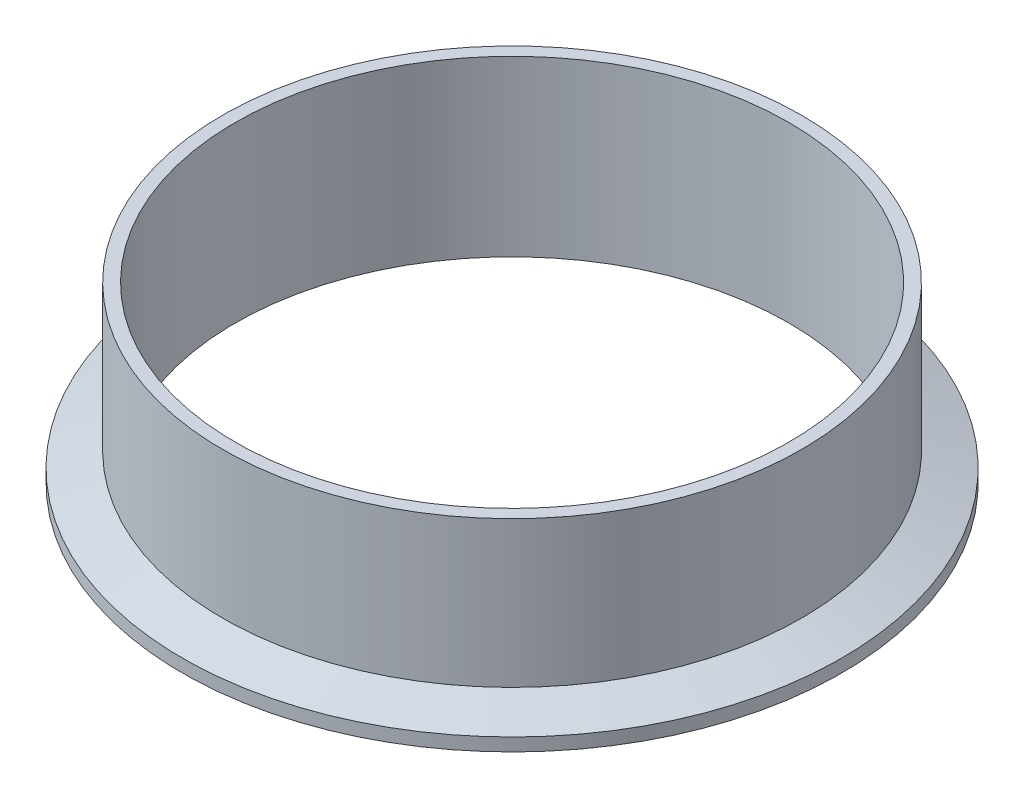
ISO-10303-21;
HEADER;
FILE_DESCRIPTION(('STEP AP214'),'2;1');
FILE_NAME('part.step','',(''),(''),'','','');
FILE_SCHEMA(('AUTOMOTIVE_DESIGN { 1 0 10303 214 1 1 1 1 }'));
ENDSEC;
DATA;
#1=APPLICATION_CONTEXT('core data for automotive mechanical design processes');
#2=APPLICATION_PROTOCOL_DEFINITION('international standard','automotive_design',2000,#1);
#3=PRODUCT_CONTEXT('',#1,'mechanical');
#4=PRODUCT('Part','Part','',(#3));
#5=PRODUCT_RELATED_PRODUCT_CATEGORY('part','',(#4));
#6=PRODUCT_DEFINITION_FORMATION('','',#4);
#7=PRODUCT_DEFINITION_CONTEXT('part definition',#1,'design');
#8=PRODUCT_DEFINITION('design','',#6,#7);
#9=PRODUCT_DEFINITION_SHAPE('','',#8);
#10=(LENGTH_UNIT() NAMED_UNIT(*) SI_UNIT(.MILLI.,.METRE.));
#11=(NAMED_UNIT(*) PLANE_ANGLE_UNIT() SI_UNIT($,.RADIAN.));
#12=(NAMED_UNIT(*) SI_UNIT($,.STERADIAN.) SOLID_ANGLE_UNIT());
#13=UNCERTAINTY_MEASURE_WITH_UNIT(LENGTH_MEASURE(1.E-05),#10,'distance_accuracy_value','');
#14=(GEOMETRIC_REPRESENTATION_CONTEXT(3) GLOBAL_UNCERTAINTY_ASSIGNED_CONTEXT((#13)) GLOBAL_UNIT_ASSIGNED_CONTEXT((#10,
#11,#12)) REPRESENTATION_CONTEXT('',''));
#15=CARTESIAN_POINT('',(0.,0.,0.));
#16=DIRECTION('',(0.,0.,1.));
#17=DIRECTION('',(1.,0.,0.));
#18=AXIS2_PLACEMENT_3D('',#15,#16,#17);
#19=CARTESIAN_POINT('',(0.,0.7874,0.));
#20=DIRECTION('',(0.,-1.,0.));
#21=DIRECTION('',(0.,0.,-1.));
#22=AXIS2_PLACEMENT_3D('',#19,#20,#21);
#23=TOROIDAL_SURFACE('',#22,69.2804084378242,0.787400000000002);
#24=CARTESIAN_POINT('',(0.,0.,0.));
#25=DIRECTION('',(0.,-1.,0.));
#26=DIRECTION('',(0.,0.,-1.));
#27=AXIS2_PLACEMENT_3D('',#24,#25,#26);
#28=CIRCLE('',#27,69.2804084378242);
#29=CARTESIAN_POINT('',(0.,0.,-69.2804084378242));
#30=VERTEX_POINT('',#29);
#31=EDGE_CURVE('E67',#30,#30,#28,.T.);
#32=ORIENTED_EDGE('',*,*,#31,.T.);
#33=EDGE_LOOP('',(#32));
#34=FACE_BOUND('',#33,.T.);
#35=CARTESIAN_POINT('',(0.,0.474458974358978,0.));
#36=DIRECTION('',(0.,-1.,0.));
#37=DIRECTION('',(0.,0.,-1.));
#38=AXIS2_PLACEMENT_3D('',#35,#36,#37);
#39=CIRCLE('',#38,68.5578666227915);
#40=CARTESIAN_POINT('',(0.,0.474458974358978,-68.5578666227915));
#41=VERTEX_POINT('',#40);
#42=EDGE_CURVE('E10',#41,#41,#39,.T.);
#43=ORIENTED_EDGE('',*,*,#42,.F.);
#44=EDGE_LOOP('',(#43));
#45=FACE_BOUND('',#44,.T.);
#46=ADVANCED_FACE('F33',(#34,#45),#23,.T.);
#47=CARTESIAN_POINT('',(0.,0.,0.));
#48=DIRECTION('',(0.,-1.,0.));
#49=DIRECTION('',(0.,0.,-1.));
#50=AXIS2_PLACEMENT_3D('',#47,#48,#49);
#51=TOROIDAL_SURFACE('',#50,67.4624,1.19380000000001);
#52=CARTESIAN_POINT('',(0.,0.474458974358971,0.));
#53=DIRECTION('',(0.,-1.,0.));
#54=DIRECTION('',(0.,0.,-1.));
#55=AXIS2_PLACEMENT_3D('',#52,#53,#54);
#56=CIRCLE('',#55,66.3669333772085);
#57=CARTESIAN_POINT('',(0.,0.474458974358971,-66.3669333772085));
#58=VERTEX_POINT('',#57);
#59=EDGE_CURVE('E39',#58,#58,#56,.T.);
#60=ORIENTED_EDGE('',*,*,#59,.F.);
#61=EDGE_LOOP('',(#60));
#62=FACE_BOUND('',#61,.T.);
#63=ORIENTED_EDGE('',*,*,#42,.T.);
#64=EDGE_LOOP('',(#63));
#65=FACE_BOUND('',#64,.T.);
#66=ADVANCED_FACE('F115',(#62,#65),#51,.F.);
#67=CARTESIAN_POINT('',(0.,0.7874,0.));
#68=DIRECTION('',(0.,-1.,0.));
#69=DIRECTION('',(0.,0.,-1.));
#70=AXIS2_PLACEMENT_3D('',#67,#68,#69);
#71=TOROIDAL_SURFACE('',#70,65.6443915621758,0.78739999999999);
#72=ORIENTED_EDGE('',*,*,#59,.T.);
#73=EDGE_LOOP('',(#72));
#74=FACE_BOUND('',#73,.T.);
#75=CARTESIAN_POINT('',(0.,0.,0.));
#76=DIRECTION('',(0.,-1.,0.));
#77=DIRECTION('',(0.,0.,-1.));
#78=AXIS2_PLACEMENT_3D('',#75,#76,#77);
#79=CIRCLE('',#78,65.6443915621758);
#80=CARTESIAN_POINT('',(0.,0.,-65.6443915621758));
#81=VERTEX_POINT('',#80);
#82=EDGE_CURVE('E43',#81,#81,#79,.T.);
#83=ORIENTED_EDGE('',*,*,#82,.F.);
#84=EDGE_LOOP('',(#83));
#85=FACE_BOUND('',#84,.T.);
#86=ADVANCED_FACE('F111',(#74,#85),#71,.T.);
#87=CARTESIAN_POINT('',(0.,0.,0.));
#88=DIRECTION('',(0.,1.,0.));
#89=DIRECTION('',(0.,0.,1.));
#90=AXIS2_PLACEMENT_3D('',#87,#88,#89);
#91=PLANE('',#90);
#92=CARTESIAN_POINT('',(0.,0.,0.));
#93=DIRECTION('',(0.,-1.,0.));
#94=DIRECTION('',(0.,0.,-1.));
#95=AXIS2_PLACEMENT_3D('',#92,#93,#94);
#96=CIRCLE('',#95,60.7314);
#97=CARTESIAN_POINT('',(0.,0.,-60.7314));
#98=VERTEX_POINT('',#97);
#99=EDGE_CURVE('E47',#98,#98,#96,.T.);
#100=ORIENTED_EDGE('',*,*,#99,.F.);
#101=EDGE_LOOP('',(#100));
#102=FACE_BOUND('',#101,.T.);
#103=ORIENTED_EDGE('',*,*,#82,.T.);
#104=EDGE_LOOP('',(#103));
#105=FACE_BOUND('',#104,.T.);
#106=ADVANCED_FACE('F105',(#102,#105),#91,.F.);
#107=CARTESIAN_POINT('',(0.,0.,0.));
#108=DIRECTION('',(0.,-1.,0.));
#109=DIRECTION('',(0.,0.,-1.));
#110=AXIS2_PLACEMENT_3D('',#107,#108,#109);
#111=CYLINDRICAL_SURFACE('',#110,60.7314);
#112=ORIENTED_EDGE('',*,*,#99,.T.);
#113=EDGE_LOOP('',(#112));
#114=FACE_BOUND('',#113,.T.);
#115=CARTESIAN_POINT('',(0.,38.1,0.));
#116=DIRECTION('',(0.,-1.,0.));
#117=DIRECTION('',(0.,0.,-1.));
#118=AXIS2_PLACEMENT_3D('',#115,#116,#117);
#119=CIRCLE('',#118,60.7314);
#120=CARTESIAN_POINT('',(0.,38.1,-60.7314));
#121=VERTEX_POINT('',#120);
#122=EDGE_CURVE('E52',#121,#121,#119,.T.);
#123=ORIENTED_EDGE('',*,*,#122,.F.);
#124=EDGE_LOOP('',(#123));
#125=FACE_BOUND('',#124,.T.);
#126=ADVANCED_FACE('F100',(#114,#125),#111,.F.);
#127=CARTESIAN_POINT('',(0.,38.1,0.));
#128=DIRECTION('',(0.,-1.,0.));
#129=DIRECTION('',(0.,0.,-1.));
#130=AXIS2_PLACEMENT_3D('',#127,#128,#129);
#131=PLANE('',#130);
#132=CARTESIAN_POINT('',(0.,38.1,0.));
#133=DIRECTION('',(0.,-1.,0.));
#134=DIRECTION('',(0.,0.,-1.));
#135=AXIS2_PLACEMENT_3D('',#132,#133,#134);
#136=CIRCLE('',#135,63.5);
#137=CARTESIAN_POINT('',(0.,38.1,-63.5));
#138=VERTEX_POINT('',#137);
#139=EDGE_CURVE('E55',#138,#138,#136,.T.);
#140=ORIENTED_EDGE('',*,*,#139,.F.);
#141=EDGE_LOOP('',(#140));
#142=FACE_BOUND('',#141,.T.);
#143=ORIENTED_EDGE('',*,*,#122,.T.);
#144=EDGE_LOOP('',(#143));
#145=FACE_BOUND('',#144,.T.);
#146=ADVANCED_FACE('F94',(#142,#145),#131,.F.);
#147=CARTESIAN_POINT('',(0.,0.,0.));
#148=DIRECTION('',(0.,-1.,0.));
#149=DIRECTION('',(0.,0.,-1.));
#150=AXIS2_PLACEMENT_3D('',#147,#148,#149);
#151=CYLINDRICAL_SURFACE('',#150,63.5);
#152=CARTESIAN_POINT('',(0.,6.04351600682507,0.));
#153=DIRECTION('',(0.,-1.,0.));
#154=DIRECTION('',(0.,0.,-1.));
#155=AXIS2_PLACEMENT_3D('',#152,#153,#154);
#156=CIRCLE('',#155,63.5);
#157=CARTESIAN_POINT('',(0.,6.04351600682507,-63.5));
#158=VERTEX_POINT('',#157);
#159=EDGE_CURVE('E58',#158,#158,#156,.T.);
#160=ORIENTED_EDGE('',*,*,#159,.F.);
#161=EDGE_LOOP('',(#160));
#162=FACE_BOUND('',#161,.T.);
#163=ORIENTED_EDGE('',*,*,#139,.T.);
#164=EDGE_LOOP('',(#163));
#165=FACE_BOUND('',#164,.T.);
#166=ADVANCED_FACE('F88',(#162,#165),#151,.T.);
#167=CARTESIAN_POINT('',(0.,6.04351600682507,0.));
#168=DIRECTION('',(0.,-1.,0.));
#169=DIRECTION('',(0.,0.,-1.));
#170=AXIS2_PLACEMENT_3D('',#167,#168,#169);
#171=CONICAL_SURFACE('',#170,63.5,1.22173047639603);
#172=CARTESIAN_POINT('',(0.,2.8448,0.));
#173=DIRECTION('',(0.,-1.,0.));
#174=DIRECTION('',(0.,0.,-1.));
#175=AXIS2_PLACEMENT_3D('',#172,#173,#174);
#176=CIRCLE('',#175,72.2884);
#177=CARTESIAN_POINT('',(0.,2.8448,-72.2884));
#178=VERTEX_POINT('',#177);
#179=EDGE_CURVE('E61',#178,#178,#176,.T.);
#180=ORIENTED_EDGE('',*,*,#179,.F.);
#181=EDGE_LOOP('',(#180));
#182=FACE_BOUND('',#181,.T.);
#183=ORIENTED_EDGE('',*,*,#159,.T.);
#184=EDGE_LOOP('',(#183));
#185=FACE_BOUND('',#184,.T.);
#186=ADVANCED_FACE('F82',(#182,#185),#171,.T.);
#187=CARTESIAN_POINT('',(0.,0.,0.));
#188=DIRECTION('',(0.,-1.,0.));
#189=DIRECTION('',(0.,0.,-1.));
#190=AXIS2_PLACEMENT_3D('',#187,#188,#189);
#191=CYLINDRICAL_SURFACE('',#190,72.2884);
#192=CARTESIAN_POINT('',(0.,0.,0.));
#193=DIRECTION('',(0.,-1.,0.));
#194=DIRECTION('',(0.,0.,-1.));
#195=AXIS2_PLACEMENT_3D('',#192,#193,#194);
#196=CIRCLE('',#195,72.2884);
#197=CARTESIAN_POINT('',(0.,0.,-72.2884));
#198=VERTEX_POINT('',#197);
#199=EDGE_CURVE('E64',#198,#198,#196,.T.);
#200=ORIENTED_EDGE('',*,*,#199,.F.);
#201=EDGE_LOOP('',(#200));
#202=FACE_BOUND('',#201,.T.);
#203=ORIENTED_EDGE('',*,*,#179,.T.);
#204=EDGE_LOOP('',(#203));
#205=FACE_BOUND('',#204,.T.);
#206=ADVANCED_FACE('F76',(#202,#205),#191,.T.);
#207=CARTESIAN_POINT('',(0.,0.,0.));
#208=DIRECTION('',(0.,1.,0.));
#209=DIRECTION('',(0.,0.,1.));
#210=AXIS2_PLACEMENT_3D('',#207,#208,#209);
#211=PLANE('',#210);
#212=ORIENTED_EDGE('',*,*,#31,.F.);
#213=EDGE_LOOP('',(#212));
#214=FACE_BOUND('',#213,.T.);
#215=ORIENTED_EDGE('',*,*,#199,.T.);
#216=EDGE_LOOP('',(#215));
#217=FACE_BOUND('',#216,.T.);
#218=ADVANCED_FACE('F73',(#214,#217),#211,.F.);
#219=CLOSED_SHELL('',(#46,#66,#86,#106,#126,#146,#166,#186,#206,#218));
#220=MANIFOLD_SOLID_BREP('B2',#219);
#221=ADVANCED_BREP_SHAPE_REPRESENTATION('',(#18,#220),#14);
#222=SHAPE_DEFINITION_REPRESENTATION(#9,#221);
ENDSEC;
END-ISO-10303-21;
